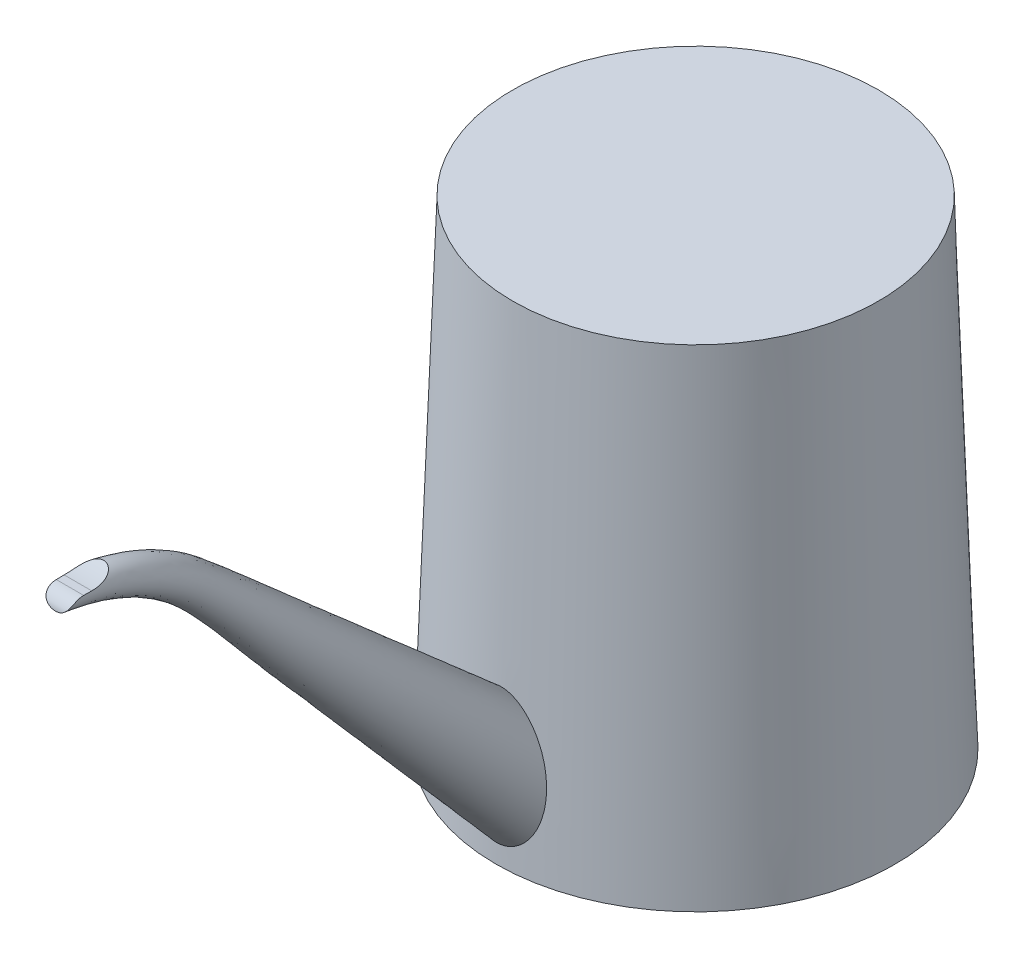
ISO-10303-21;
HEADER;
FILE_DESCRIPTION(('STEP AP214'),'2;1');
FILE_NAME('part.step','',(''),(''),'','','');
FILE_SCHEMA(('AUTOMOTIVE_DESIGN { 1 0 10303 214 1 1 1 1 }'));
ENDSEC;
DATA;
#1=APPLICATION_CONTEXT('core data for automotive mechanical design processes');
#2=APPLICATION_PROTOCOL_DEFINITION('international standard','automotive_design',2000,#1);
#3=PRODUCT_CONTEXT('',#1,'mechanical');
#4=PRODUCT('Part','Part','',(#3));
#5=PRODUCT_RELATED_PRODUCT_CATEGORY('part','',(#4));
#6=PRODUCT_DEFINITION_FORMATION('','',#4);
#7=PRODUCT_DEFINITION_CONTEXT('part definition',#1,'design');
#8=PRODUCT_DEFINITION('design','',#6,#7);
#9=PRODUCT_DEFINITION_SHAPE('','',#8);
#10=(LENGTH_UNIT() NAMED_UNIT(*) SI_UNIT(.MILLI.,.METRE.));
#11=(NAMED_UNIT(*) PLANE_ANGLE_UNIT() SI_UNIT($,.RADIAN.));
#12=(NAMED_UNIT(*) SI_UNIT($,.STERADIAN.) SOLID_ANGLE_UNIT());
#13=UNCERTAINTY_MEASURE_WITH_UNIT(LENGTH_MEASURE(1.E-05),#10,'distance_accuracy_value','');
#14=(GEOMETRIC_REPRESENTATION_CONTEXT(3) GLOBAL_UNCERTAINTY_ASSIGNED_CONTEXT((#13)) GLOBAL_UNIT_ASSIGNED_CONTEXT((#10,
#11,#12)) REPRESENTATION_CONTEXT('',''));
#15=CARTESIAN_POINT('',(0.,0.,0.));
#16=DIRECTION('',(0.,0.,1.));
#17=DIRECTION('',(1.,0.,0.));
#18=AXIS2_PLACEMENT_3D('',#15,#16,#17);
#19=CARTESIAN_POINT('',(0.0137913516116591,35.9210210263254,51.3460910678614));
#20=CARTESIAN_POINT('',(0.00853062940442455,47.1881624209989,64.2598504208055));
#21=CARTESIAN_POINT('',(0.000397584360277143,64.6000250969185,84.216206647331));
#22=CARTESIAN_POINT('',(-0.0101148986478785,87.1372068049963,110.046981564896));
#23=CARTESIAN_POINT('',(-0.018268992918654,104.550425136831,130.003797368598));
#24=CARTESIAN_POINT('',(-0.0258231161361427,120.950707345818,148.803713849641));
#25=CARTESIAN_POINT('',(-0.0342925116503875,138.338552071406,168.720379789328));
#26=CARTESIAN_POINT('',(-0.0429280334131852,161.042959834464,194.806477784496));
#27=CARTESIAN_POINT('',(-0.0627914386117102,181.433025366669,217.834366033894));
#28=CARTESIAN_POINT('',(-0.0552290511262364,198.939988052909,238.404401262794));
#29=CARTESIAN_POINT('',(-0.0530300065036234,205.722927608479,248.954972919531));
#30=CARTESIAN_POINT('',(-0.0511989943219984,210.37160475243,257.470493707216));
#31=CARTESIAN_POINT('',(-0.0488957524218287,215.245442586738,268.981393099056));
#32=CARTESIAN_POINT('',(-0.0471023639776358,218.093400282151,278.175481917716));
#33=CARTESIAN_POINT('',(-0.0447893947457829,220.926202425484,290.247832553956));
#34=CARTESIAN_POINT('',(-0.0433146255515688,221.558003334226,298.090562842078));
#35=CARTESIAN_POINT('',(-0.0421564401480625,222.224269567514,304.230493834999));
#36=CARTESIAN_POINT('',(-0.599524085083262,35.9213285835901,51.3457835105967));
#37=CARTESIAN_POINT('',(-0.579222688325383,47.1883524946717,64.2596602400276));
#38=CARTESIAN_POINT('',(-0.547460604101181,64.6000324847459,84.2161992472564));
#39=CARTESIAN_POINT('',(-0.506618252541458,87.1369857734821,110.047202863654));
#40=CARTESIAN_POINT('',(-0.475026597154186,104.550031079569,130.00419326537));
#41=CARTESIAN_POINT('',(-0.445276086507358,120.950154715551,148.804265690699));
#42=CARTESIAN_POINT('',(-0.413758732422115,138.337837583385,168.721106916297));
#43=CARTESIAN_POINT('',(-0.372471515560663,161.042043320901,194.80734067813));
#44=CARTESIAN_POINT('',(-0.336073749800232,181.43195334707,217.835745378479));
#45=CARTESIAN_POINT('',(-0.303527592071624,198.938789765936,238.405348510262));
#46=CARTESIAN_POINT('',(-0.288399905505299,205.721694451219,248.95576300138));
#47=CARTESIAN_POINT('',(-0.276665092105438,210.370355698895,257.471159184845));
#48=CARTESIAN_POINT('',(-0.26150819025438,215.244190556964,268.981902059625));
#49=CARTESIAN_POINT('',(-0.249779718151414,218.092160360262,278.175875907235));
#50=CARTESIAN_POINT('',(-0.234633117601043,220.924989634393,290.248084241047));
#51=CARTESIAN_POINT('',(-0.2249363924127,221.556822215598,298.090732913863));
#52=CARTESIAN_POINT('',(-0.217385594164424,222.223110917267,304.230598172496));
#53=CARTESIAN_POINT('',(-1.81464774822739,35.8816987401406,51.3854133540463));
#54=CARTESIAN_POINT('',(-1.74321031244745,47.1503431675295,64.2976869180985));
#55=CARTESIAN_POINT('',(-1.63299096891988,64.5645275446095,84.251753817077));
#56=CARTESIAN_POINT('',(-1.49024257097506,87.1047270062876,110.079533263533));
#57=CARTESIAN_POINT('',(-1.37991387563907,104.52029551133,130.034031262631));
#58=CARTESIAN_POINT('',(-1.27623177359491,120.922762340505,148.83171985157));
#59=CARTESIAN_POINT('',(-1.16547597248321,138.313085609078,168.746116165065));
#60=CARTESIAN_POINT('',(-1.02526247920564,161.019987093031,194.828630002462));
#61=CARTESIAN_POINT('',(-0.8773565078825,181.416200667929,217.856172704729));
#62=CARTESIAN_POINT('',(-0.795329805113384,198.92056339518,238.419752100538));
#63=CARTESIAN_POINT('',(-0.754592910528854,205.703145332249,248.967639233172));
#64=CARTESIAN_POINT('',(-0.723241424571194,210.351695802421,257.481094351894));
#65=CARTESIAN_POINT('',(-0.682622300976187,215.225690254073,268.989414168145));
#66=CARTESIAN_POINT('',(-0.651221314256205,218.074005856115,278.181640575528));
#67=CARTESIAN_POINT('',(-0.610635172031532,220.9074616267,290.251710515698));
#68=CARTESIAN_POINT('',(-0.584786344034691,221.539907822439,298.093185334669));
#69=CARTESIAN_POINT('',(-0.564452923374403,222.206646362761,304.232080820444));
#70=CARTESIAN_POINT('',(-3.5970697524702,35.7061534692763,51.5609586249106));
#71=CARTESIAN_POINT('',(-3.45097776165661,46.9825702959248,64.4655363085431));
#72=CARTESIAN_POINT('',(-3.22514312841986,64.4088073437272,84.4076917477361));
#73=CARTESIAN_POINT('',(-2.93296262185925,86.9645574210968,110.220015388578));
#74=CARTESIAN_POINT('',(-2.70706982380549,104.392190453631,130.162574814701));
#75=CARTESIAN_POINT('',(-2.49490195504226,120.805848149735,148.948909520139));
#76=CARTESIAN_POINT('',(-2.26786316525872,138.20868468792,168.851572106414));
#77=CARTESIAN_POINT('',(-1.98248960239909,160.928574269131,194.916990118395));
#78=CARTESIAN_POINT('',(-1.67089442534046,181.353326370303,217.937767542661));
#79=CARTESIAN_POINT('',(-1.51633953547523,198.847572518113,238.47743227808));
#80=CARTESIAN_POINT('',(-1.43805373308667,205.628940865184,249.015146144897));
#81=CARTESIAN_POINT('',(-1.37794025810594,210.277097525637,257.520810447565));
#82=CARTESIAN_POINT('',(-1.29998995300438,215.151808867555,269.019410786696));
#83=CARTESIAN_POINT('',(-1.23973982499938,218.001571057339,278.204638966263));
#84=CARTESIAN_POINT('',(-1.16186951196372,220.837616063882,290.266157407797));
#85=CARTESIAN_POINT('',(-1.11223102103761,221.472576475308,298.102941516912));
#86=CARTESIAN_POINT('',(-1.07325238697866,222.141151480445,304.237978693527));
#87=CARTESIAN_POINT('',(-5.33348640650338,35.4191420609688,51.847970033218));
#88=CARTESIAN_POINT('',(-5.11451955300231,46.7085206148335,64.7397115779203));
#89=CARTESIAN_POINT('',(-4.77615303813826,64.1547026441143,84.6621515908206));
#90=CARTESIAN_POINT('',(-4.33830313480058,86.7362779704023,110.448804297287));
#91=CARTESIAN_POINT('',(-3.99978819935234,104.183923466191,130.371553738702));
#92=CARTESIAN_POINT('',(-3.68188952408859,120.616144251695,149.139064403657));
#93=CARTESIAN_POINT('',(-3.34152061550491,138.039706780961,169.022247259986));
#94=CARTESIAN_POINT('',(-2.91468497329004,160.78117411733,195.059511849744));
#95=CARTESIAN_POINT('',(-2.44350544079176,181.252787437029,218.068264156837));
#96=CARTESIAN_POINT('',(-2.21834683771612,198.730768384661,238.569734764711));
#97=CARTESIAN_POINT('',(-2.10349734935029,205.510223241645,249.091149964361));
#98=CARTESIAN_POINT('',(-2.01537763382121,210.157767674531,257.584340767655));
#99=CARTESIAN_POINT('',(-1.90107598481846,215.033654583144,269.067381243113));
#100=CARTESIAN_POINT('',(-1.81273594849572,217.88575326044,278.241412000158));
#101=CARTESIAN_POINT('',(-1.69855611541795,220.725972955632,290.289245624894));
#102=CARTESIAN_POINT('',(-1.62578441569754,221.364961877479,298.118559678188));
#103=CARTESIAN_POINT('',(-1.56862172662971,222.036502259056,304.247402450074));
#104=CARTESIAN_POINT('',(-15.4415030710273,33.0560829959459,54.2110290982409));
#105=CARTESIAN_POINT('',(-14.7986383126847,44.4517232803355,66.997531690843));
#106=CARTESIAN_POINT('',(-13.8042968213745,62.0646683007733,86.7551101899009));
#107=CARTESIAN_POINT('',(-12.5182613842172,84.8599025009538,112.329368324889));
#108=CARTESIAN_POINT('',(-11.5238453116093,102.473409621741,132.087911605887));
#109=CARTESIAN_POINT('',(-10.5902158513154,119.05939323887,150.699530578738));
#110=CARTESIAN_POINT('',(-9.58983678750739,136.654554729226,170.421274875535));
#111=CARTESIAN_POINT('',(-8.33923412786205,159.574895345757,196.22602563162));
#112=CARTESIAN_POINT('',(-6.93836612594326,180.433049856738,219.132342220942));
#113=CARTESIAN_POINT('',(-6.30252278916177,197.778092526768,239.322568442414));
#114=CARTESIAN_POINT('',(-5.97492507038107,204.542044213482,249.710980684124));
#115=CARTESIAN_POINT('',(-5.72385425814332,209.184661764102,258.102410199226));
#116=CARTESIAN_POINT('',(-5.39804626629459,214.070235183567,269.458528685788));
#117=CARTESIAN_POINT('',(-5.14626026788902,216.941485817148,278.541202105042));
#118=CARTESIAN_POINT('',(-4.82083542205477,219.815821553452,290.477516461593));
#119=CARTESIAN_POINT('',(-4.61332717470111,220.488019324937,298.245345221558));
#120=CARTESIAN_POINT('',(-4.4504854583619,221.183543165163,304.324212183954));
#121=CARTESIAN_POINT('',(-22.2189063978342,25.9017968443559,61.3653152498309));
#122=CARTESIAN_POINT('',(-21.2799310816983,37.6573710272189,73.7953053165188));
#123=CARTESIAN_POINT('',(-19.8565495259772,55.7387181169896,93.0898182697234));
#124=CARTESIAN_POINT('',(-17.9958906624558,79.198474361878,118.003459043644));
#125=CARTESIAN_POINT('',(-16.559985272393,97.3182282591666,137.260681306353));
#126=CARTESIAN_POINT('',(-15.2112709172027,114.375620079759,155.394564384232));
#127=CARTESIAN_POINT('',(-13.7660472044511,132.495589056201,174.621689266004));
#128=CARTESIAN_POINT('',(-11.9607669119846,155.964451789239,199.718358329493));
#129=CARTESIAN_POINT('',(-9.93078190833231,177.996942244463,222.295055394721));
#130=CARTESIAN_POINT('',(-9.02209555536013,194.945070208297,241.561299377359));
#131=CARTESIAN_POINT('',(-8.5526212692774,201.663519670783,251.553791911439));
#132=CARTESIAN_POINT('',(-8.192939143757,206.291830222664,259.642542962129));
#133=CARTESIAN_POINT('',(-7.72608324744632,211.206912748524,270.620864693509));
#134=CARTESIAN_POINT('',(-7.36546635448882,214.135163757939,279.432732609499));
#135=CARTESIAN_POINT('',(-6.89883316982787,217.112735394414,291.03506318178));
#136=CARTESIAN_POINT('',(-6.60416057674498,217.875781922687,298.637440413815));
#137=CARTESIAN_POINT('',(-6.36847348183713,218.650380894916,304.552325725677));
#138=CARTESIAN_POINT('',(-22.232607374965,8.05898295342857,79.208129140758));
#139=CARTESIAN_POINT('',(-21.3108319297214,20.5669915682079,90.8928073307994));
#140=CARTESIAN_POINT('',(-19.8513588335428,40.0059335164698,108.844786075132));
#141=CARTESIAN_POINT('',(-17.9867358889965,65.0857352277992,132.147700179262));
#142=CARTESIAN_POINT('',(-16.5415638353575,84.479931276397,150.142789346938));
#143=CARTESIAN_POINT('',(-15.1856805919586,102.71460717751,167.083665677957));
#144=CARTESIAN_POINT('',(-13.7319604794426,122.147826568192,185.072429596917));
#145=CARTESIAN_POINT('',(-11.9181307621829,146.989421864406,208.400432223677));
#146=CARTESIAN_POINT('',(-9.86840242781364,171.953668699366,230.14117767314));
#147=CARTESIAN_POINT('',(-8.96722708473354,187.915845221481,247.115963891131));
#148=CARTESIAN_POINT('',(-8.49994076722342,194.521805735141,256.125866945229));
#149=CARTESIAN_POINT('',(-8.14205444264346,199.115027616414,263.463239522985));
#150=CARTESIAN_POINT('',(-7.67757189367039,204.103244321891,273.505136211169));
#151=CARTESIAN_POINT('',(-7.31843069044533,207.175080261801,281.641342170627));
#152=CARTESIAN_POINT('',(-6.85495444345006,210.404124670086,292.425578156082));
#153=CARTESIAN_POINT('',(-6.55566236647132,211.429094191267,299.543041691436));
#154=CARTESIAN_POINT('',(-6.32659329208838,212.367554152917,305.118099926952));
#155=CARTESIAN_POINT('',(-12.2801000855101,0.00615460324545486,87.260957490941));
#156=CARTESIAN_POINT('',(-11.8152811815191,12.9253917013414,98.5382789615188));
#157=CARTESIAN_POINT('',(-10.9446883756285,32.8922676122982,115.968293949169));
#158=CARTESIAN_POINT('',(-9.92201216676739,58.7266928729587,138.520973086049));
#159=CARTESIAN_POINT('',(-9.11625585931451,78.694887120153,155.947556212));
#160=CARTESIAN_POINT('',(-8.36338280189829,97.464187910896,172.346768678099));
#161=CARTESIAN_POINT('',(-7.55498827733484,117.492107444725,189.77438997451));
#162=CARTESIAN_POINT('',(-6.54796596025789,142.956233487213,212.302357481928));
#163=CARTESIAN_POINT('',(-5.40285603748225,169.245314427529,233.657694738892));
#164=CARTESIAN_POINT('',(-4.91073858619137,184.764832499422,249.605970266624));
#165=CARTESIAN_POINT('',(-4.65437273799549,191.320631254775,258.175218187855));
#166=CARTESIAN_POINT('',(-4.45807243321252,195.898221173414,265.175845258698));
#167=CARTESIAN_POINT('',(-4.20350541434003,200.919706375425,274.797427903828));
#168=CARTESIAN_POINT('',(-4.00586838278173,204.055269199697,282.632508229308));
#169=CARTESIAN_POINT('',(-3.75355511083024,207.399653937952,293.045122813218));
#170=CARTESIAN_POINT('',(-3.57609763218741,208.525558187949,299.980169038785));
#171=CARTESIAN_POINT('',(-3.46242664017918,209.552557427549,305.371592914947));
#172=CARTESIAN_POINT('',(12.2525173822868,-0.00614768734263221,87.2732597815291));
#173=CARTESIAN_POINT('',(11.7982193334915,12.9173108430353,98.5463579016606));
#174=CARTESIAN_POINT('',(10.9438933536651,32.8920911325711,115.968472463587));
#175=CARTESIAN_POINT('',(9.94224194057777,58.7355150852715,138.512139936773));
#176=CARTESIAN_POINT('',(9.15279385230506,78.7106552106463,155.93171461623));
#177=CARTESIAN_POINT('',(8.41502903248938,97.4862917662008,172.324696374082));
#178=CARTESIAN_POINT('',(7.62357330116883,117.520687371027,189.745304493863));
#179=CARTESIAN_POINT('',(6.63382202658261,142.992893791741,212.267841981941));
#180=CARTESIAN_POINT('',(5.52843891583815,169.288195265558,233.602520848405));
#181=CARTESIAN_POINT('',(5.02119668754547,184.812763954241,249.568080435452));
#182=CARTESIAN_POINT('',(4.7604327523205,191.369957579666,258.14361481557));
#183=CARTESIAN_POINT('',(4.56047040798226,195.948182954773,265.149227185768));
#184=CARTESIAN_POINT('',(4.30129696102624,200.969788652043,274.777066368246));
#185=CARTESIAN_POINT('',(4.10007295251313,204.104861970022,282.616760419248));
#186=CARTESIAN_POINT('',(3.84313430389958,207.448176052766,293.035025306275));
#187=CARTESIAN_POINT('',(3.66272330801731,208.572710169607,299.973632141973));
#188=CARTESIAN_POINT('',(3.5467395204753,209.598903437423,305.367419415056));
#189=CARTESIAN_POINT('',(22.2173840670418,8.03669276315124,79.2304193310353));
#190=CARTESIAN_POINT('',(21.3009256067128,20.5531442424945,90.906650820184));
#191=CARTESIAN_POINT('',(19.8510420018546,40.0054159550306,108.845307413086));
#192=CARTESIAN_POINT('',(17.9978814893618,65.1017516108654,132.131663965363));
#193=CARTESIAN_POINT('',(16.561735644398,84.5084914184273,150.11409602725));
#194=CARTESIAN_POINT('',(15.214183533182,102.754658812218,167.043671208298));
#195=CARTESIAN_POINT('',(13.7698139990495,122.199609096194,185.019731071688));
#196=CARTESIAN_POINT('',(11.9655157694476,147.055846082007,208.337894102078));
#197=CARTESIAN_POINT('',(9.9377135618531,172.031363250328,230.041209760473));
#198=CARTESIAN_POINT('',(9.02819054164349,188.002690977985,247.04731220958));
#199=CARTESIAN_POINT('',(8.55847692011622,194.611178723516,256.068605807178));
#200=CARTESIAN_POINT('',(8.19856901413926,199.205552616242,263.415009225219));
#201=CARTESIAN_POINT('',(7.73154574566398,204.193985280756,273.468248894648));
#202=CARTESIAN_POINT('',(7.37041895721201,207.264942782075,281.612789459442));
#203=CARTESIAN_POINT('',(6.90440640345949,210.492023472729,292.407332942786));
#204=CARTESIAN_POINT('',(6.60336732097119,211.51467922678,299.530753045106));
#205=CARTESIAN_POINT('',(6.37312683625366,212.451527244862,305.110538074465));
#206=CARTESIAN_POINT('',(22.2310850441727,25.8795066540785,61.3876054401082));
#207=CARTESIAN_POINT('',(21.2878566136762,37.6437277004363,73.8089488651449));
#208=CARTESIAN_POINT('',(19.8568028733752,55.7381497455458,93.0903894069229));
#209=CARTESIAN_POINT('',(17.9869742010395,79.2144988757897,117.987414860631));
#210=CARTESIAN_POINT('',(16.5438478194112,97.3467859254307,137.23199041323));
#211=CARTESIAN_POINT('',(15.1884685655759,114.415672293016,155.354569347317));
#212=CARTESIAN_POINT('',(13.7357643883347,132.547371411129,174.568990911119));
#213=CARTESIAN_POINT('',(11.9228589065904,156.030876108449,199.655820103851));
#214=CARTESIAN_POINT('',(9.87533300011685,178.074636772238,222.19508752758));
#215=CARTESIAN_POINT('',(8.97332479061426,195.031915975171,241.492647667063));
#216=CARTESIAN_POINT('',(8.50579234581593,201.752892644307,251.496530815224));
#217=CARTESIAN_POINT('',(8.14772749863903,206.382355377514,259.594312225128));
#218=CARTESIAN_POINT('',(7.68290412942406,211.297653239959,270.583978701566));
#219=CARTESIAN_POINT('',(7.32387587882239,214.225028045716,279.40417488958));
#220=CARTESIAN_POINT('',(6.85927125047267,217.200629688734,291.016830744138));
#221=CARTESIAN_POINT('',(6.56599972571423,217.961406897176,298.625038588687));
#222=CARTESIAN_POINT('',(6.3312466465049,218.734353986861,304.54476387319));
#223=CARTESIAN_POINT('',(15.4646740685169,33.0405845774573,54.2265275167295));
#224=CARTESIAN_POINT('',(14.812960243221,44.4421745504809,67.0070853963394));
#225=CARTESIAN_POINT('',(13.8049674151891,62.06428867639,86.7554905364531));
#226=CARTESIAN_POINT('',(12.5012668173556,84.8710418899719,112.318215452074));
#227=CARTESIAN_POINT('',(11.4931515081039,102.493266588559,132.06796194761));
#228=CARTESIAN_POINT('',(10.5468301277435,119.087241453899,150.67172213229));
#229=CARTESIAN_POINT('',(9.53222158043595,136.690559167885,170.384633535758));
#230=CARTESIAN_POINT('',(8.26711027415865,159.621080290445,196.182542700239));
#231=CARTESIAN_POINT('',(6.83286955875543,180.48707104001,219.06283432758));
#232=CARTESIAN_POINT('',(6.20973186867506,197.838476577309,239.274834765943));
#233=CARTESIAN_POINT('',(5.88582878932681,204.604185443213,249.671166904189));
#234=CARTESIAN_POINT('',(5.63783427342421,209.247604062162,258.068875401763));
#235=CARTESIAN_POINT('',(5.31589600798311,214.13332737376,269.432881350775));
#236=CARTESIAN_POINT('',(5.06712301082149,217.003968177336,278.521347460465));
#237=CARTESIAN_POINT('',(4.74558446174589,219.876935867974,290.464835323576));
#238=CARTESIAN_POINT('',(4.5405522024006,220.547543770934,298.236758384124));
#239=CARTESIAN_POINT('',(4.3796579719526,221.2419298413,304.318954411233));
#240=CARTESIAN_POINT('',(5.36029423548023,35.4137794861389,51.8533326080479));
#241=CARTESIAN_POINT('',(5.13110190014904,46.7052177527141,64.743016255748));
#242=CARTESIAN_POINT('',(4.77692577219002,64.154571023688,84.6622834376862));
#243=CARTESIAN_POINT('',(4.31864166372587,86.7401323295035,110.444945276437));
#244=CARTESIAN_POINT('',(3.96427666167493,104.190794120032,130.364651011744));
#245=CARTESIAN_POINT('',(3.63169417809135,120.625779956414,149.129442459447));
#246=CARTESIAN_POINT('',(3.27486233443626,138.05216459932,169.009569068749));
#247=CARTESIAN_POINT('',(2.83124084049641,160.797154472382,195.044466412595));
#248=CARTESIAN_POINT('',(2.32145053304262,181.271479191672,218.044213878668));
#249=CARTESIAN_POINT('',(2.11099180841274,198.751661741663,238.553218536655));
#250=CARTESIAN_POINT('',(2.00041685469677,205.531724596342,249.077374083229));
#251=CARTESIAN_POINT('',(1.91585628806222,210.179546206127,257.572737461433));
#252=CARTESIAN_POINT('',(1.80603171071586,215.055484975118,269.058507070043));
#253=CARTESIAN_POINT('',(1.72117770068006,217.907372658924,278.234542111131));
#254=CARTESIAN_POINT('',(1.61149381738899,220.747118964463,290.284857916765));
#255=CARTESIAN_POINT('',(1.54158903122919,221.38555802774,298.115587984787));
#256=CARTESIAN_POINT('',(1.4866774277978,222.056704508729,304.245583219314));
#257=CARTESIAN_POINT('',(3.62431969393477,35.7025321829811,51.5645799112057));
#258=CARTESIAN_POINT('',(3.46783308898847,46.9803396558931,64.467768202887));
#259=CARTESIAN_POINT('',(3.22592872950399,64.4087185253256,84.4077807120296));
#260=CARTESIAN_POINT('',(2.91297687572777,86.9671602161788,110.217409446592));
#261=CARTESIAN_POINT('',(2.67097263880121,104.39683013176,130.157913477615));
#262=CARTESIAN_POINT('',(2.44387879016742,120.812355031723,148.942411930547));
#263=CARTESIAN_POINT('',(2.20010556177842,138.217097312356,168.843010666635));
#264=CARTESIAN_POINT('',(1.89766931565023,160.93936562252,194.90683010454));
#265=CARTESIAN_POINT('',(1.54682659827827,181.365948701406,217.921526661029));
#266=CARTESIAN_POINT('',(1.40721401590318,198.861681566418,238.466279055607));
#267=CARTESIAN_POINT('',(1.33327324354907,205.643460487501,249.005843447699));
#268=CARTESIAN_POINT('',(1.27677761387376,210.291804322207,257.512974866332));
#269=CARTESIAN_POINT('',(1.20337821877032,215.166550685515,269.013418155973));
#270=CARTESIAN_POINT('',(1.14667159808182,218.016170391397,278.199999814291));
#271=CARTESIAN_POINT('',(1.07337141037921,220.851895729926,290.26319442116));
#272=CARTESIAN_POINT('',(1.02664691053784,221.486484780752,298.100934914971));
#273=CARTESIAN_POINT('',(0.989956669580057,222.154793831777,304.236750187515));
#274=CARTESIAN_POINT('',(1.84216865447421,35.8798649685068,51.38724712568));
#275=CARTESIAN_POINT('',(1.76023337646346,47.1492142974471,64.2988164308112));
#276=CARTESIAN_POINT('',(1.63378434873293,64.5644823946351,84.2517990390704));
#277=CARTESIAN_POINT('',(1.47005809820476,87.1060450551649,110.078213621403));
#278=CARTESIAN_POINT('',(1.3434577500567,104.522644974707,130.031670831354));
#279=CARTESIAN_POINT('',(1.22470125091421,120.926057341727,148.828429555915));
#280=CARTESIAN_POINT('',(1.09704460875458,138.317345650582,168.74178076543));
#281=CARTESIAN_POINT('',(0.939598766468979,161.025451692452,194.823485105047));
#282=CARTESIAN_POINT('',(0.752054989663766,181.422592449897,217.84794853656));
#283=CARTESIAN_POINT('',(0.685119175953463,198.927708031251,238.414104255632));
#284=CARTESIAN_POINT('',(0.648770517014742,205.710497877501,248.962928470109));
#285=CARTESIAN_POINT('',(0.621072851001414,210.359143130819,257.477126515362));
#286=CARTESIAN_POINT('',(0.58504989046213,215.233155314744,268.986379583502));
#287=CARTESIAN_POINT('',(0.557227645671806,218.08139877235,278.179291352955));
#288=CARTESIAN_POINT('',(0.521257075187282,220.914692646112,290.250210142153));
#289=CARTESIAN_POINT('',(0.498351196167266,221.546950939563,298.092168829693));
#290=CARTESIAN_POINT('',(0.480328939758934,222.213554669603,304.231458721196));
#291=CARTESIAN_POINT('',(0.627106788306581,35.9207134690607,51.3463986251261));
#292=CARTESIAN_POINT('',(0.596283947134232,47.1879723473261,64.2600406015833));
#293=CARTESIAN_POINT('',(0.548255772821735,64.6000177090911,84.2162140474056));
#294=CARTESIAN_POINT('',(0.486388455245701,87.1374278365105,110.046760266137));
#295=CARTESIAN_POINT('',(0.438488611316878,104.550819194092,130.003401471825));
#296=CARTESIAN_POINT('',(0.393629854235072,120.951259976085,148.803162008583));
#297=CARTESIAN_POINT('',(0.34517370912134,138.339266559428,168.719652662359));
#298=CARTESIAN_POINT('',(0.286615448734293,161.043876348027,194.805614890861));
#299=CARTESIAN_POINT('',(0.210490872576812,181.434097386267,217.832986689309));
#300=CARTESIAN_POINT('',(0.193069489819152,198.941186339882,238.403454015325));
#301=CARTESIAN_POINT('',(0.182339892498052,205.724160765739,248.954182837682));
#302=CARTESIAN_POINT('',(0.174267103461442,210.372853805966,257.469828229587));
#303=CARTESIAN_POINT('',(0.163716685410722,215.246694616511,268.980884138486));
#304=CARTESIAN_POINT('',(0.155574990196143,218.094640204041,278.175087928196));
#305=CARTESIAN_POINT('',(0.145054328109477,220.927415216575,290.247580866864));
#306=CARTESIAN_POINT('',(0.138307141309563,221.559184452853,298.090392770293));
#307=CARTESIAN_POINT('',(0.133072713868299,222.22542821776,304.230389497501));
#308=CARTESIAN_POINT('',(0.0137913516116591,35.9210210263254,51.3460910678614));
#309=CARTESIAN_POINT('',(0.00853062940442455,47.1881624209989,64.2598504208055));
#310=CARTESIAN_POINT('',(0.000397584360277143,64.6000250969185,84.216206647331));
#311=CARTESIAN_POINT('',(-0.0101148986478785,87.1372068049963,110.046981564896));
#312=CARTESIAN_POINT('',(-0.018268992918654,104.550425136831,130.003797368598));
#313=CARTESIAN_POINT('',(-0.0258231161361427,120.950707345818,148.803713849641));
#314=CARTESIAN_POINT('',(-0.0342925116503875,138.338552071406,168.720379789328));
#315=CARTESIAN_POINT('',(-0.0429280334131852,161.042959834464,194.806477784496));
#316=CARTESIAN_POINT('',(-0.0627914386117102,181.433025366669,217.834366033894));
#317=CARTESIAN_POINT('',(-0.0552290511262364,198.939988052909,238.404401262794));
#318=CARTESIAN_POINT('',(-0.0530300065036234,205.722927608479,248.954972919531));
#319=CARTESIAN_POINT('',(-0.0511989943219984,210.37160475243,257.470493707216));
#320=CARTESIAN_POINT('',(-0.0488957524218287,215.245442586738,268.981393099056));
#321=CARTESIAN_POINT('',(-0.0471023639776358,218.093400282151,278.175481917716));
#322=CARTESIAN_POINT('',(-0.0447893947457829,220.926202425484,290.247832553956));
#323=CARTESIAN_POINT('',(-0.0433146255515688,221.558003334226,298.090562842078));
#324=CARTESIAN_POINT('',(-0.0421564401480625,222.224269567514,304.230493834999));
#325=B_SPLINE_SURFACE_WITH_KNOTS('',3,3,((#19,#20,#21,#22,#23,#24,#25,#26,#27,#28,#29,#30,#31,
#32,#33,#34,#35),(#36,#37,#38,#39,#40,#41,#42,#43,#44,#45,#46,#47,#48,#49,#50,#51,#52),(#53,#54,
#55,#56,#57,#58,#59,#60,#61,#62,#63,#64,#65,#66,#67,#68,#69),(#70,#71,#72,#73,#74,#75,#76,#77,
#78,#79,#80,#81,#82,#83,#84,#85,#86),(#87,#88,#89,#90,#91,#92,#93,#94,#95,#96,#97,#98,#99,#100,
#101,#102,#103),(#104,#105,#106,#107,#108,#109,#110,#111,#112,#113,#114,#115,#116,#117,#118,
#119,#120),(#121,#122,#123,#124,#125,#126,#127,#128,#129,#130,#131,#132,#133,#134,#135,#136,
#137),(#138,#139,#140,#141,#142,#143,#144,#145,#146,#147,#148,#149,#150,#151,#152,#153,#154),
(#155,#156,#157,#158,#159,#160,#161,#162,#163,#164,#165,#166,#167,#168,#169,#170,#171),(#172,
#173,#174,#175,#176,#177,#178,#179,#180,#181,#182,#183,#184,#185,#186,#187,#188),(#189,#190,
#191,#192,#193,#194,#195,#196,#197,#198,#199,#200,#201,#202,#203,#204,#205),(#206,#207,#208,
#209,#210,#211,#212,#213,#214,#215,#216,#217,#218,#219,#220,#221,#222),(#223,#224,#225,#226,
#227,#228,#229,#230,#231,#232,#233,#234,#235,#236,#237,#238,#239),(#240,#241,#242,#243,#244,
#245,#246,#247,#248,#249,#250,#251,#252,#253,#254,#255,#256),(#257,#258,#259,#260,#261,#262,
#263,#264,#265,#266,#267,#268,#269,#270,#271,#272,#273),(#274,#275,#276,#277,#278,#279,#280,
#281,#282,#283,#284,#285,#286,#287,#288,#289,#290),(#291,#292,#293,#294,#295,#296,#297,#298,
#299,#300,#301,#302,#303,#304,#305,#306,#307),(#308,#309,#310,#311,#312,#313,#314,#315,#316,
#317,#318,#319,#320,#321,#322,#323,#324)),.UNSPECIFIED.,.T.,.F.,.F.,(4,1,1,1,1,2,2,2,1,1,1,1,4),
(4,1,1,1,1,1,1,1,1,1,1,1,1,1,4),(0.,0.0125,0.0249999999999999,0.0375000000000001,0.05,0.25,0.5,
0.75,0.95,0.9625,0.975,0.9875,1.),(0.,0.164162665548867,0.253705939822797,0.328325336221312,
0.417868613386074,0.49248801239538,0.582031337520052,0.746190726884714,0.802008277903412,
0.817246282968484,0.857862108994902,0.888329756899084,0.928945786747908,0.944183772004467,1.),.UNSPECIFIED.);
#326=CARTESIAN_POINT('',(0.,8.79638906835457,94.9428233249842));
#327=CARTESIAN_POINT('',(-0.458097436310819,8.79641152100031,94.9428210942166));
#328=CARTESIAN_POINT('',(-0.916292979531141,8.81644238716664,94.9387977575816));
#329=CARTESIAN_POINT('',(-1.82905913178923,8.89681353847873,94.9227941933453));
#330=CARTESIAN_POINT('',(-2.28362886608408,8.95716326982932,94.9108121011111));
#331=CARTESIAN_POINT('',(-3.18575827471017,9.11760783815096,94.8792106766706));
#332=CARTESIAN_POINT('',(-3.63331279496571,9.21773059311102,94.8595859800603));
#333=CARTESIAN_POINT('',(-4.51766757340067,9.45627931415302,94.8132443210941));
#334=CARTESIAN_POINT('',(-4.95446824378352,9.59470380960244,94.7865276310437));
#335=CARTESIAN_POINT('',(-5.81234458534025,9.90701367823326,94.7268566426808));
#336=CARTESIAN_POINT('',(-6.23348545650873,10.0807263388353,94.6939327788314));
#337=CARTESIAN_POINT('',(-7.059872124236,10.4615048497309,94.6225765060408));
#338=CARTESIAN_POINT('',(-7.46511806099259,10.6685704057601,94.5841441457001));
#339=CARTESIAN_POINT('',(-8.25802845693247,11.1133549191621,94.5026263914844));
#340=CARTESIAN_POINT('',(-8.64568778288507,11.3510827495,94.4595396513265));
#341=CARTESIAN_POINT('',(-9.40212862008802,11.854376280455,94.3695860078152));
#342=CARTESIAN_POINT('',(-9.77090598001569,12.1199480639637,94.3227182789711));
#343=CARTESIAN_POINT('',(-10.3733319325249,12.5867193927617,94.2415942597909));
#344=CARTESIAN_POINT('',(-10.6123382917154,12.7811974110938,94.2081223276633));
#345=CARTESIAN_POINT('',(-11.0810269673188,13.1807792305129,94.1400940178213));
#346=CARTESIAN_POINT('',(-11.310711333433,13.3858806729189,94.1055378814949));
#347=CARTESIAN_POINT('',(-11.9858655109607,14.0161245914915,94.0005718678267));
#348=CARTESIAN_POINT('',(-12.4173648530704,14.4561507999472,93.9288741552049));
#349=CARTESIAN_POINT('',(-13.2433202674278,15.3703366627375,93.7837472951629));
#350=CARTESIAN_POINT('',(-13.6377223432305,15.8445443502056,93.7103158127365));
#351=CARTESIAN_POINT('',(-14.3894364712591,16.8213868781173,93.5633222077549));
#352=CARTESIAN_POINT('',(-14.7467470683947,17.3240228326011,93.4897600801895));
#353=CARTESIAN_POINT('',(-15.5541474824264,18.5488036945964,93.316051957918));
#354=CARTESIAN_POINT('',(-15.9879232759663,19.281804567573,93.2164222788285));
#355=CARTESIAN_POINT('',(-16.789792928,20.7835093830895,93.0220466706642));
#356=CARTESIAN_POINT('',(-17.1578633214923,21.552225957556,92.9273024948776));
#357=CARTESIAN_POINT('',(-17.8319768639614,23.1180033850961,92.7446269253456));
#358=CARTESIAN_POINT('',(-18.1379558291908,23.9150925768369,92.6567026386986));
#359=CARTESIAN_POINT('',(-18.6907887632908,25.5301638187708,92.489226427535));
#360=CARTESIAN_POINT('',(-18.9376424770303,26.348145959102,92.409674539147));
#361=CARTESIAN_POINT('',(-19.4617604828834,28.3249918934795,92.2304458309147));
#362=CARTESIAN_POINT('',(-19.7127564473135,29.4913131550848,92.1351708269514));
#363=CARTESIAN_POINT('',(-20.0138805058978,31.2543153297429,92.0070243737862));
#364=CARTESIAN_POINT('',(-20.1017091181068,31.844421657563,91.9667596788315));
#365=CARTESIAN_POINT('',(-20.2531440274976,33.0280899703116,91.8912050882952));
#366=CARTESIAN_POINT('',(-20.3167508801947,33.6216518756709,91.8559150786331));
#367=CARTESIAN_POINT('',(-20.4206447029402,34.8118956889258,91.7902935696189));
#368=CARTESIAN_POINT('',(-20.4608989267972,35.4085807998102,91.7599690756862));
#369=CARTESIAN_POINT('',(-20.5187346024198,36.6032795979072,91.7043027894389));
#370=CARTESIAN_POINT('',(-20.5363158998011,37.2012932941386,91.6789610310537));
#371=CARTESIAN_POINT('',(-20.5495001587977,38.3976736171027,91.633190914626));
#372=CARTESIAN_POINT('',(-20.5451055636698,38.9960401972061,91.6127620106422));
#373=CARTESIAN_POINT('',(-20.5150496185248,40.1923795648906,91.5766850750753));
#374=CARTESIAN_POINT('',(-20.4893881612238,40.7903523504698,91.5610370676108));
#375=CARTESIAN_POINT('',(-20.4159111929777,42.0035074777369,91.5340443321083));
#376=CARTESIAN_POINT('',(-20.3674385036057,42.6186533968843,91.522846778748));
#377=CARTESIAN_POINT('',(-20.24811609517,43.8468414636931,91.5053928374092));
#378=CARTESIAN_POINT('',(-20.1772663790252,44.459883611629,91.499136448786));
#379=CARTESIAN_POINT('',(-20.0131645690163,45.6830626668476,91.4914459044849));
#380=CARTESIAN_POINT('',(-19.9199100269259,46.2931992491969,91.490012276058));
#381=CARTESIAN_POINT('',(-19.7109058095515,47.5096013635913,91.4918165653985));
#382=CARTESIAN_POINT('',(-19.5951562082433,48.1158669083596,91.4950544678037));
#383=CARTESIAN_POINT('',(-19.3411395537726,49.3228541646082,91.5060078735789));
#384=CARTESIAN_POINT('',(-19.2029001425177,49.9235817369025,91.5137179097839));
#385=CARTESIAN_POINT('',(-18.9035270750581,51.1192324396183,91.5333926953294));
#386=CARTESIAN_POINT('',(-18.7423937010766,51.7141556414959,91.5453573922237));
#387=CARTESIAN_POINT('',(-18.3968782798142,52.8969509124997,91.5732882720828));
#388=CARTESIAN_POINT('',(-18.21250277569,53.4848249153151,91.589253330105));
#389=CARTESIAN_POINT('',(-17.8199460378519,54.6524008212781,91.6249027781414));
#390=CARTESIAN_POINT('',(-17.611766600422,55.2321033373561,91.6445868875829));
#391=CARTESIAN_POINT('',(-17.0972569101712,56.5740412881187,91.6945070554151));
#392=CARTESIAN_POINT('',(-16.7813633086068,57.3325966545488,91.7260718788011));
#393=CARTESIAN_POINT('',(-16.1037631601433,58.8287590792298,91.7944121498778));
#394=CARTESIAN_POINT('',(-15.7420564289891,59.566366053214,91.8311876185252));
#395=CARTESIAN_POINT('',(-14.9701589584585,61.0150406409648,91.9089210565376));
#396=CARTESIAN_POINT('',(-14.5600073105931,61.7261290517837,91.9498756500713));
#397=CARTESIAN_POINT('',(-13.9056745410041,62.7678335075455,92.0135296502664));
#398=CARTESIAN_POINT('',(-13.6810598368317,63.1108949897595,92.0351167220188));
#399=CARTESIAN_POINT('',(-13.2182282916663,63.7876630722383,92.0788532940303));
#400=CARTESIAN_POINT('',(-12.9800124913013,64.1213703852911,92.1010027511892));
#401=CARTESIAN_POINT('',(-12.4016542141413,64.89567247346,92.1536566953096));
#402=CARTESIAN_POINT('',(-12.0555237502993,65.3318193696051,92.1843166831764));
#403=CARTESIAN_POINT('',(-11.3356394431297,66.1807587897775,92.2457363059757));
#404=CARTESIAN_POINT('',(-10.9618850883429,66.5935508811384,92.2764959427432));
#405=CARTESIAN_POINT('',(-10.1857024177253,67.3905118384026,92.3373931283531));
#406=CARTESIAN_POINT('',(-9.78331242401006,67.7747176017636,92.3675314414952));
#407=CARTESIAN_POINT('',(-9.15724617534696,68.3252799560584,92.4116675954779));
#408=CARTESIAN_POINT('',(-8.94483572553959,68.5044909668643,92.4261995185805));
#409=CARTESIAN_POINT('',(-8.51232551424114,68.853546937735,92.4547955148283));
#410=CARTESIAN_POINT('',(-8.29222396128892,69.0233896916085,92.4688594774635));
#411=CARTESIAN_POINT('',(-7.74581463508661,69.4251492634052,92.5024456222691));
#412=CARTESIAN_POINT('',(-7.41536902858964,69.6515158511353,92.521648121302));
#413=CARTESIAN_POINT('',(-6.7388380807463,70.0795393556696,92.5583954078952));
#414=CARTESIAN_POINT('',(-6.39275732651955,70.2812034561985,92.5759406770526));
#415=CARTESIAN_POINT('',(-5.68573186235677,70.6563771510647,92.6089251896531));
#416=CARTESIAN_POINT('',(-5.3247957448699,70.8299027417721,92.6243656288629));
#417=CARTESIAN_POINT('',(-4.58922461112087,71.1454137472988,92.6526911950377));
#418=CARTESIAN_POINT('',(-4.21458974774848,71.2873995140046,92.6655763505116));
#419=CARTESIAN_POINT('',(-3.44953490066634,71.5378597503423,92.6884731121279));
#420=CARTESIAN_POINT('',(-3.05898635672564,71.6459471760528,92.6984514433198));
#421=CARTESIAN_POINT('',(-2.26908908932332,71.8235768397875,92.714943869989));
#422=CARTESIAN_POINT('',(-1.86974030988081,71.8931188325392,92.7214579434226));
#423=CARTESIAN_POINT('',(-1.0662755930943,71.9917280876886,92.730732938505));
#424=CARTESIAN_POINT('',(-0.662162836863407,72.020820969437,92.7334962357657));
#425=CARTESIAN_POINT('',(0.14692444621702,72.0381579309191,92.7351376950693));
#426=CARTESIAN_POINT('',(0.551898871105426,72.0264066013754,92.7340162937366));
#427=CARTESIAN_POINT('',(1.29768919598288,71.9670368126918,92.7284090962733));
#428=CARTESIAN_POINT('',(1.63897411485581,71.9250921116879,92.7244559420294));
#429=CARTESIAN_POINT('',(2.31668736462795,71.8125875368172,92.7139285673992));
#430=CARTESIAN_POINT('',(2.65311654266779,71.7420327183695,92.707354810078));
#431=CARTESIAN_POINT('',(3.31904827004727,71.5736850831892,92.6917858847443));
#432=CARTESIAN_POINT('',(3.64854988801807,71.47588862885,92.6827903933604));
#433=CARTESIAN_POINT('',(4.29886520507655,71.2549048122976,92.6626303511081));
#434=CARTESIAN_POINT('',(4.61967734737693,71.1317129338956,92.6514654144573));
#435=CARTESIAN_POINT('',(5.34999194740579,70.8198912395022,92.6234607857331));
#436=CARTESIAN_POINT('',(5.75588480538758,70.6228421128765,92.6059380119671));
#437=CARTESIAN_POINT('',(6.54850197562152,70.1936350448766,92.5682938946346));
#438=CARTESIAN_POINT('',(6.93522077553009,69.9614670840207,92.5481718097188));
#439=CARTESIAN_POINT('',(7.68927347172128,69.4664407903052,92.5059240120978));
#440=CARTESIAN_POINT('',(8.05657134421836,69.2035281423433,92.4837947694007));
#441=CARTESIAN_POINT('',(8.77090922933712,68.6517428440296,92.4381400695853));
#442=CARTESIAN_POINT('',(9.11794830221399,68.3628689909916,92.4146145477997));
#443=CARTESIAN_POINT('',(9.97304896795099,67.6020090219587,92.3538163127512));
#444=CARTESIAN_POINT('',(10.467651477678,67.1149055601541,92.3159373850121));
#445=CARTESIAN_POINT('',(11.4125195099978,66.0994782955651,92.2396267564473));
#446=CARTESIAN_POINT('',(11.8627607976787,65.5711322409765,92.2011947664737));
#447=CARTESIAN_POINT('',(12.7224203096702,64.4808031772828,92.1249496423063));
#448=CARTESIAN_POINT('',(13.131764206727,63.9187617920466,92.0871377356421));
#449=CARTESIAN_POINT('',(13.9114751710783,62.7683697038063,92.0132057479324));
#450=CARTESIAN_POINT('',(14.2818447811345,62.1800207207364,91.9770855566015));
#451=CARTESIAN_POINT('',(15.0132907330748,60.9356472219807,91.9046665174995));
#452=CARTESIAN_POINT('',(15.371450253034,60.2779018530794,91.8685685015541));
#453=CARTESIAN_POINT('',(16.0482255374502,58.9418661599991,91.8001273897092));
#454=CARTESIAN_POINT('',(16.3668214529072,58.2635657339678,91.7677861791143));
#455=CARTESIAN_POINT('',(16.9663886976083,56.89022238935,91.7076017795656));
#456=CARTESIAN_POINT('',(17.2473520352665,56.1951759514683,91.6797595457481));
#457=CARTESIAN_POINT('',(17.7734076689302,54.7907538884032,91.6291886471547));
#458=CARTESIAN_POINT('',(18.018466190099,54.0813654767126,91.6064647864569));
#459=CARTESIAN_POINT('',(18.4735253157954,52.6515087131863,91.5667198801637));
#460=CARTESIAN_POINT('',(18.683535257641,51.931043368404,91.5496973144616));
#461=CARTESIAN_POINT('',(19.0694082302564,50.480969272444,91.5218256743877));
#462=CARTESIAN_POINT('',(19.2452730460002,49.7513610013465,91.5109762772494));
#463=CARTESIAN_POINT('',(19.570816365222,48.250754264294,91.4955089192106));
#464=CARTESIAN_POINT('',(19.718900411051,47.4794065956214,91.4912035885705));
#465=CARTESIAN_POINT('',(19.9786852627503,45.9305630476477,91.4901883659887));
#466=CARTESIAN_POINT('',(20.0903832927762,45.153066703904,91.4934790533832));
#467=CARTESIAN_POINT('',(20.2775539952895,43.5936706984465,91.5079562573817));
#468=CARTESIAN_POINT('',(20.3530221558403,42.8117705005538,91.5191437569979));
#469=CARTESIAN_POINT('',(20.4390113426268,41.6372753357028,91.5419903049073));
#470=CARTESIAN_POINT('',(20.4631370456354,41.2455717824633,91.5506146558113));
#471=CARTESIAN_POINT('',(20.5023334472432,40.4617618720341,91.569893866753));
#472=CARTESIAN_POINT('',(20.5174041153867,40.069655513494,91.5805487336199));
#473=CARTESIAN_POINT('',(20.5489009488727,38.8931363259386,91.6155950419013));
#474=CARTESIAN_POINT('',(20.5516215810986,38.1083921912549,91.6430707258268));
#475=CARTESIAN_POINT('',(20.518993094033,36.540161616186,91.7064994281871));
#476=CARTESIAN_POINT('',(20.4836483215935,35.7566750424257,91.742451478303));
#477=CARTESIAN_POINT('',(20.3564019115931,33.9543433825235,91.8352566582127));
#478=CARTESIAN_POINT('',(20.2505397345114,32.9365883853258,91.895140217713));
#479=CARTESIAN_POINT('',(19.9669659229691,30.9119648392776,92.0295195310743));
#480=CARTESIAN_POINT('',(19.7892505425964,29.9050968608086,92.1040160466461));
#481=CARTESIAN_POINT('',(19.3574404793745,27.9100781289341,92.2669215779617));
#482=CARTESIAN_POINT('',(19.1034328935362,26.9219073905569,92.3553146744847));
#483=CARTESIAN_POINT('',(18.5137101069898,24.97153573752,92.5447986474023));
#484=CARTESIAN_POINT('',(18.1780236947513,24.0093258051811,92.6458850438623));
#485=CARTESIAN_POINT('',(17.5284836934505,22.3928640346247,92.8279992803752));
#486=CARTESIAN_POINT('',(17.2361257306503,21.7296441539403,92.9064327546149));
#487=CARTESIAN_POINT('',(16.6049374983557,20.4261064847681,93.0675578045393));
#488=CARTESIAN_POINT('',(16.2661088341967,19.7857879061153,93.1502492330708));
#489=CARTESIAN_POINT('',(15.5402816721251,18.5341119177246,93.3183944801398));
#490=CARTESIAN_POINT('',(15.1533267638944,17.9227289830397,93.4038457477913));
#491=CARTESIAN_POINT('',(14.3292414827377,16.7348970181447,93.5757779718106));
#492=CARTESIAN_POINT('',(13.8921246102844,16.1584386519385,93.6622586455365));
#493=CARTESIAN_POINT('',(13.0776231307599,15.1815098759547,93.8133961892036));
#494=CARTESIAN_POINT('',(12.7110925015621,14.7720142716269,93.878307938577));
#495=CARTESIAN_POINT('',(11.9481002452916,13.981551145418,94.0062885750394));
#496=CARTESIAN_POINT('',(11.5516403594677,13.6005819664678,94.0693575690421));
#497=CARTESIAN_POINT('',(10.7292502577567,12.8717677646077,94.1923135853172));
#498=CARTESIAN_POINT('',(10.3033430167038,12.5238974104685,94.2522030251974));
#499=CARTESIAN_POINT('',(9.64307905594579,12.030425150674,94.3385815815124));
#500=CARTESIAN_POINT('',(9.41943258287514,11.8706620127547,94.3667975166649));
#501=CARTESIAN_POINT('',(8.96508793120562,11.5611100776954,94.4219034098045));
#502=CARTESIAN_POINT('',(8.73438792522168,11.4113238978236,94.4487930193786));
#503=CARTESIAN_POINT('',(8.11202234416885,11.0272411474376,94.5182557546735));
#504=CARTESIAN_POINT('',(7.7144002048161,10.8022471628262,94.559496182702));
#505=CARTESIAN_POINT('',(6.90217515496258,10.384484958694,94.6368769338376));
#506=CARTESIAN_POINT('',(6.48757544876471,10.1917106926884,94.6730182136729));
#507=CARTESIAN_POINT('',(5.64400453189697,9.84127291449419,94.7393073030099));
#508=CARTESIAN_POINT('',(5.21505519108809,9.68355854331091,94.769463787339));
#509=CARTESIAN_POINT('',(4.34491106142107,9.40527002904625,94.8230679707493));
#510=CARTESIAN_POINT('',(3.90371969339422,9.28468562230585,94.8465175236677));
#511=CARTESIAN_POINT('',(3.17486698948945,9.11930018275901,94.878866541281));
#512=CARTESIAN_POINT('',(2.88988319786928,9.06289860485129,94.8899536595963));
#513=CARTESIAN_POINT('',(2.31711978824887,8.96608140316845,94.9090486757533));
#514=CARTESIAN_POINT('',(2.02934044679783,8.92566421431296,94.9170568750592));
#515=CARTESIAN_POINT('',(1.45175593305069,8.8609807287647,94.9299072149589));
#516=CARTESIAN_POINT('',(1.16194982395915,8.83672247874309,94.934747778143));
#517=CARTESIAN_POINT('',(0.581442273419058,8.80442008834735,94.9412064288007));
#518=CARTESIAN_POINT('',(0.290740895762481,8.7963748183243,94.9428247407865));
#519=CARTESIAN_POINT('',(0.,8.79638906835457,94.9428233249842));
#520=B_SPLINE_CURVE_WITH_KNOTS('',3,(#326,#327,#328,#329,#330,#331,#332,#333,#334,#335,#336,
#337,#338,#339,#340,#341,#342,#343,#344,#345,#346,#347,#348,#349,#350,#351,#352,#353,#354,#355,
#356,#357,#358,#359,#360,#361,#362,#363,#364,#365,#366,#367,#368,#369,#370,#371,#372,#373,#374,
#375,#376,#377,#378,#379,#380,#381,#382,#383,#384,#385,#386,#387,#388,#389,#390,#391,#392,#393,
#394,#395,#396,#397,#398,#399,#400,#401,#402,#403,#404,#405,#406,#407,#408,#409,#410,#411,#412,
#413,#414,#415,#416,#417,#418,#419,#420,#421,#422,#423,#424,#425,#426,#427,#428,#429,#430,#431,
#432,#433,#434,#435,#436,#437,#438,#439,#440,#441,#442,#443,#444,#445,#446,#447,#448,#449,#450,
#451,#452,#453,#454,#455,#456,#457,#458,#459,#460,#461,#462,#463,#464,#465,#466,#467,#468,#469,
#470,#471,#472,#473,#474,#475,#476,#477,#478,#479,#480,#481,#482,#483,#484,#485,#486,#487,#488,
#489,#490,#491,#492,#493,#494,#495,#496,#497,#498,#499,#500,#501,#502,#503,#504,#505,#506,#507,
#508,#509,#510,#511,#512,#513,#514,#515,#516,#517,#518,#519),.UNSPECIFIED.,.T.,.F.,(4,2,2,2,2,2,
2,2,2,2,2,2,2,2,2,2,2,2,2,2,2,2,2,2,2,2,2,2,2,2,2,2,2,2,2,2,2,2,2,2,2,2,2,2,2,2,2,2,2,2,2,2,2,2,
2,2,2,2,2,2,2,2,2,2,2,2,2,2,2,2,2,2,2,2,2,2,2,2,2,2,2,2,2,2,2,2,2,2,2,2,2,2,2,2,2,2,4),(0.,
1.37399619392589,2.74831441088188,4.12359901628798,5.49883082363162,6.86748727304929,
8.23613164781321,9.60517296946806,10.9745140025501,11.9040356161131,12.833351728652,
14.692256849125,16.5538271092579,18.415470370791,20.9842722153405,23.5539896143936,
26.1263499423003,28.6987213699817,32.2835015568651,34.0770071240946,35.8704715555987,
37.6664448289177,39.4624303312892,41.2582161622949,43.0540110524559,44.905044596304,
46.7560778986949,48.6073135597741,50.4585431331,52.3075143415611,54.1564627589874,
56.0048918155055,57.8531814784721,60.3185900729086,62.7840085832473,65.2474510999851,
66.479033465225,67.7105217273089,69.3823630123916,71.0542352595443,72.723910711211,
73.558560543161,74.3934061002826,75.5954046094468,76.7970527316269,77.9980153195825,
79.1989645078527,80.4131647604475,81.6273727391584,82.840811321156,84.054113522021,
85.0845186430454,86.1147417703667,87.1451025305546,88.175646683,89.5281991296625,
90.8811381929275,92.2365046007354,93.591933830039,95.6742854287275,97.7577683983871,
99.8449715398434,101.932038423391,104.179976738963,106.429038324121,108.678576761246,
110.930217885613,113.181258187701,115.432180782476,117.787587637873,120.143174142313,
122.499053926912,123.676580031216,124.854110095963,127.208775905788,129.56317285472,
132.635569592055,135.708126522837,138.777188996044,141.845171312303,144.030643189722,
146.216039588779,148.399470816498,150.582315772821,152.241106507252,153.899800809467,
155.557215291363,156.385861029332,157.214723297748,158.589406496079,159.963831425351,
161.336249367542,162.708287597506,163.580034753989,164.451696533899,165.323792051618,
166.195826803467),.UNSPECIFIED.);
#521=CARTESIAN_POINT('',(0.,8.79638906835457,94.9428233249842));
#522=VERTEX_POINT('',#521);
#523=EDGE_CURVE('E145',#522,#522,#520,.T.);
#524=CARTESIAN_POINT('',(-6.54003566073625,215.9,298.449997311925));
#525=CARTESIAN_POINT('',(-6.54423217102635,215.9,298.238351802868));
#526=CARTESIAN_POINT('',(-6.54819549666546,215.9,298.02670159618));
#527=CARTESIAN_POINT('',(-6.55562604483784,215.9,297.60339536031));
#528=CARTESIAN_POINT('',(-6.55909327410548,215.9,297.391739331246));
#529=CARTESIAN_POINT('',(-6.56550198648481,215.9,296.968420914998));
#530=CARTESIAN_POINT('',(-6.56844347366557,215.9,296.756758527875));
#531=CARTESIAN_POINT('',(-6.57376483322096,215.9,296.333426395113));
#532=CARTESIAN_POINT('',(-6.57614470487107,215.9,296.121756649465));
#533=CARTESIAN_POINT('',(-6.58030257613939,215.9,295.698409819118));
#534=CARTESIAN_POINT('',(-6.58208057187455,215.9,295.486732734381));
#535=CARTESIAN_POINT('',(-6.58498744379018,215.9,295.063370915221));
#536=CARTESIAN_POINT('',(-6.5861163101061,215.9,294.85168618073));
#537=CARTESIAN_POINT('',(-6.58689697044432,215.9,294.64));
#538=B_SPLINE_CURVE_WITH_KNOTS('',3,(#524,#525,#526,#527,#528,#529,#530,#531,#532,#533,#534,
#535,#536,#537),.UNSPECIFIED.,.F.,.F.,(4,2,2,2,2,2,4),(0.,0.635061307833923,1.27011399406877,
1.90516176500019,2.54021035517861,3.17526304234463,3.81032537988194),.UNSPECIFIED.);
#539=CARTESIAN_POINT('',(-6.54003566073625,215.9,298.449997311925));
#540=VERTEX_POINT('',#539);
#541=CARTESIAN_POINT('',(-6.58689697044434,215.899999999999,294.64));
#542=VERTEX_POINT('',#541);
#543=EDGE_CURVE('E121',#540,#542,#538,.T.);
#544=CARTESIAN_POINT('',(-6.58689697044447,215.899999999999,294.64));
#545=CARTESIAN_POINT('',(-6.58789544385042,215.899996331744,294.360143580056));
#546=CARTESIAN_POINT('',(-6.58728748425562,215.904625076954,294.080267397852));
#547=CARTESIAN_POINT('',(-6.5819236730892,215.923166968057,293.519583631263));
#548=CARTESIAN_POINT('',(-6.57714887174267,215.937122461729,293.238777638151));
#549=CARTESIAN_POINT('',(-6.56247076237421,215.97438658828,292.67716442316));
#550=CARTESIAN_POINT('',(-6.55255388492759,215.997719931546,292.396359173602));
#551=CARTESIAN_POINT('',(-6.52638271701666,216.05370771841,291.835687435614));
#552=CARTESIAN_POINT('',(-6.51012219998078,216.086371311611,291.555822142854));
#553=CARTESIAN_POINT('',(-6.46955735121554,216.161494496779,290.993457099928));
#554=CARTESIAN_POINT('',(-6.44513001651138,216.204100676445,290.710985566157));
#555=CARTESIAN_POINT('',(-6.3866425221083,216.298572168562,290.148930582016));
#556=CARTESIAN_POINT('',(-6.35259395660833,216.350426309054,289.869344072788));
#557=CARTESIAN_POINT('',(-6.27297432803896,216.463045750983,289.314040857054));
#558=CARTESIAN_POINT('',(-6.22742035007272,216.523797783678,289.038319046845));
#559=CARTESIAN_POINT('',(-6.12263185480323,216.65375403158,288.491718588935));
#560=CARTESIAN_POINT('',(-6.06340948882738,216.722950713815,288.220835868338));
#561=CARTESIAN_POINT('',(-5.94388701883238,216.852798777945,287.745010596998));
#562=CARTESIAN_POINT('',(-5.88677839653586,216.911909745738,287.538846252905));
#563=CARTESIAN_POINT('',(-5.76163926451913,217.034353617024,287.131091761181));
#564=CARTESIAN_POINT('',(-5.69360809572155,217.097686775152,286.929501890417));
#565=CARTESIAN_POINT('',(-5.54555586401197,217.227787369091,286.532465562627));
#566=CARTESIAN_POINT('',(-5.46556312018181,217.294546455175,286.337005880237));
#567=CARTESIAN_POINT('',(-5.29229282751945,217.430816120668,285.953023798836));
#568=CARTESIAN_POINT('',(-5.19901550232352,217.500326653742,285.76450128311));
#569=CARTESIAN_POINT('',(-4.99675831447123,217.641992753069,285.393452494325));
#570=CARTESIAN_POINT('',(-4.88758682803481,217.714171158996,285.211038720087));
#571=CARTESIAN_POINT('',(-4.65348950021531,217.858937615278,284.856686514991));
#572=CARTESIAN_POINT('',(-4.52856179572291,217.931525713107,284.68474932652));
#573=CARTESIAN_POINT('',(-4.2624495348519,218.0753331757,284.353728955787));
#574=CARTESIAN_POINT('',(-4.12128905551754,218.146554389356,284.194627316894));
#575=CARTESIAN_POINT('',(-3.82229114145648,218.285756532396,283.891399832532));
#576=CARTESIAN_POINT('',(-3.6644623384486,218.3537391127,283.747266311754));
#577=CARTESIAN_POINT('',(-3.38529993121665,218.463468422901,283.519597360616));
#578=CARTESIAN_POINT('',(-3.26833886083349,218.506678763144,283.431375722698));
#579=CARTESIAN_POINT('',(-3.02709315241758,218.589815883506,283.263872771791));
#580=CARTESIAN_POINT('',(-2.90281045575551,218.629743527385,283.184589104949));
#581=CARTESIAN_POINT('',(-2.6474169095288,218.705545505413,283.035793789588));
#582=CARTESIAN_POINT('',(-2.51630917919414,218.741421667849,282.966277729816));
#583=CARTESIAN_POINT('',(-2.24785562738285,218.808403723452,282.837739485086));
#584=CARTESIAN_POINT('',(-2.11050957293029,218.839509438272,282.778717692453));
#585=CARTESIAN_POINT('',(-1.82964896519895,218.896423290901,282.671564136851));
#586=CARTESIAN_POINT('',(-1.68610429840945,218.922200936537,282.623494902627));
#587=CARTESIAN_POINT('',(-1.39461778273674,218.967643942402,282.539249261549));
#588=CARTESIAN_POINT('',(-1.24667600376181,218.987309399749,282.503072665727));
#589=CARTESIAN_POINT('',(-0.947583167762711,219.020079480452,282.443020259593));
#590=CARTESIAN_POINT('',(-0.79643178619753,219.033183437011,282.419145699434));
#591=CARTESIAN_POINT('',(-0.492241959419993,219.052545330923,282.383933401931));
#592=CARTESIAN_POINT('',(-0.339203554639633,219.0588034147,282.372595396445));
#593=CARTESIAN_POINT('',(-0.0459952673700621,219.06416817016,282.362874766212));
#594=CARTESIAN_POINT('',(0.094130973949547,219.063851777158,282.363446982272));
#595=CARTESIAN_POINT('',(0.37381784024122,219.057450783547,282.375047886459));
#596=CARTESIAN_POINT('',(0.513378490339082,219.051366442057,282.386076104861));
#597=CARTESIAN_POINT('',(0.790839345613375,219.033497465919,282.418575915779));
#598=CARTESIAN_POINT('',(0.928740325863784,219.021715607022,282.440042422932));
#599=CARTESIAN_POINT('',(1.20195932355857,218.992665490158,282.493241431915));
#600=CARTESIAN_POINT('',(1.33727729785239,218.975397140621,282.524974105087));
#601=CARTESIAN_POINT('',(1.60284324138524,218.935937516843,282.597973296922));
#602=CARTESIAN_POINT('',(1.73313193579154,218.91380600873,282.639124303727));
#603=CARTESIAN_POINT('',(1.98953129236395,218.864918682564,282.730767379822));
#604=CARTESIAN_POINT('',(2.11564052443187,218.83816130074,282.781262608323));
#605=CARTESIAN_POINT('',(2.3629476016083,218.780522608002,282.891086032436));
#606=CARTESIAN_POINT('',(2.4841460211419,218.749641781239,282.950413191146));
#607=CARTESIAN_POINT('',(2.7211475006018,218.684281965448,283.07737065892));
#608=CARTESIAN_POINT('',(2.83694853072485,218.649801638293,283.145004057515));
#609=CARTESIAN_POINT('',(3.07030389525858,218.575388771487,283.292783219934));
#610=CARTESIAN_POINT('',(3.187451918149,218.535245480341,283.373464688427));
#611=CARTESIAN_POINT('',(3.41477240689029,218.452189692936,283.542860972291));
#612=CARTESIAN_POINT('',(3.52494212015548,218.409276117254,283.631578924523));
#613=CARTESIAN_POINT('',(3.84465275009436,218.277385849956,283.908696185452));
#614=CARTESIAN_POINT('',(4.04349166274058,218.185227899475,284.108120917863));
#615=CARTESIAN_POINT('',(4.36926679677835,218.019303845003,284.481221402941));
#616=CARTESIAN_POINT('',(4.50217788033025,217.946236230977,284.650123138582));
#617=CARTESIAN_POINT('',(4.75167924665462,217.799823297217,284.999587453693));
#618=CARTESIAN_POINT('',(4.86826249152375,217.726477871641,285.180155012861));
#619=CARTESIAN_POINT('',(5.08607135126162,217.580979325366,285.551114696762));
#620=CARTESIAN_POINT('',(5.18727379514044,217.508828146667,285.741521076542));
#621=CARTESIAN_POINT('',(5.37527475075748,217.367038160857,286.130231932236));
#622=CARTESIAN_POINT('',(5.46207011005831,217.297399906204,286.328538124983));
#623=CARTESIAN_POINT('',(5.62509158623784,217.159391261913,286.738149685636));
#624=CARTESIAN_POINT('',(5.700878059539,217.091137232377,286.949668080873));
#625=CARTESIAN_POINT('',(5.83988004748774,216.959137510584,287.378269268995));
#626=CARTESIAN_POINT('',(5.90308894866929,216.89539420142,287.595354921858));
#627=CARTESIAN_POINT('',(6.01833748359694,216.773044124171,288.033920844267));
#628=CARTESIAN_POINT('',(6.07037477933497,216.714438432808,288.25540202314));
#629=CARTESIAN_POINT('',(6.16481398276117,216.602595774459,288.702695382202));
#630=CARTESIAN_POINT('',(6.20717708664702,216.549380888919,288.92852119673));
#631=CARTESIAN_POINT('',(6.28327439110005,216.448913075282,289.38285271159));
#632=CARTESIAN_POINT('',(6.31701097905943,216.401658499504,289.611357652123));
#633=CARTESIAN_POINT('',(6.37703629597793,216.313317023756,290.070500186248));
#634=CARTESIAN_POINT('',(6.40332551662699,216.272229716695,290.301137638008));
#635=CARTESIAN_POINT('',(6.44903407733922,216.197153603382,290.75929457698));
#636=CARTESIAN_POINT('',(6.46858408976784,216.163035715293,290.986780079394));
#637=CARTESIAN_POINT('',(6.50243551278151,216.100951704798,291.442976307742));
#638=CARTESIAN_POINT('',(6.51673682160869,216.072985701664,291.671687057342));
#639=CARTESIAN_POINT('',(6.54087435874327,216.02326645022,292.130041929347));
#640=CARTESIAN_POINT('',(6.55071002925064,216.001513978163,292.359686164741));
#641=CARTESIAN_POINT('',(6.56650618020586,215.964483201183,292.816929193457));
#642=CARTESIAN_POINT('',(6.57251047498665,215.949132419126,293.044520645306));
#643=CARTESIAN_POINT('',(6.5814029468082,215.924568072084,293.500056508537));
#644=CARTESIAN_POINT('',(6.58429161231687,215.915353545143,293.728000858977));
#645=CARTESIAN_POINT('',(6.58742982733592,215.903070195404,294.183966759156));
#646=CARTESIAN_POINT('',(6.58768061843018,215.899998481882,294.411988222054));
#647=CARTESIAN_POINT('',(6.58685115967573,215.899999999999,294.64));
#648=B_SPLINE_CURVE_WITH_KNOTS('',3,(#544,#545,#546,#547,#548,#549,#550,#551,#552,#553,#554,
#555,#556,#557,#558,#559,#560,#561,#562,#563,#564,#565,#566,#567,#568,#569,#570,#571,#572,#573,
#574,#575,#576,#577,#578,#579,#580,#581,#582,#583,#584,#585,#586,#587,#588,#589,#590,#591,#592,
#593,#594,#595,#596,#597,#598,#599,#600,#601,#602,#603,#604,#605,#606,#607,#608,#609,#610,#611,
#612,#613,#614,#615,#616,#617,#618,#619,#620,#621,#622,#623,#624,#625,#626,#627,#628,#629,#630,
#631,#632,#633,#634,#635,#636,#637,#638,#639,#640,#641,#642,#643,#644,#645,#646,#647),
.UNSPECIFIED.,.F.,.F.,(4,2,2,2,2,2,2,2,2,2,2,2,2,2,2,2,2,2,2,2,2,2,2,2,2,2,2,2,2,2,2,2,2,2,2,2,
2,2,2,2,2,2,2,2,2,2,2,2,2,2,2,4),(0.,0.83955291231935,1.68294392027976,2.52857196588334,
3.37503213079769,4.23486299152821,5.09366208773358,5.95119332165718,6.80796511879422,
7.4734874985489,8.1390500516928,8.80306112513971,9.46706102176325,10.1398559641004,
10.812730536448,11.4846196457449,12.1561625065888,12.6139685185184,13.0716536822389,
13.5291314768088,13.9866263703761,14.4466711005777,14.9067085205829,15.3667926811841,
15.8268670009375,16.2467531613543,16.6666204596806,17.0862834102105,17.5059533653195,
17.9207286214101,18.33564436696,18.7505114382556,19.1655332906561,19.6084804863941,
20.0516013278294,20.9374892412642,21.6176663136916,22.2981356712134,22.979620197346,
23.6612536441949,24.3652276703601,25.0695708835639,25.7740613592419,26.4813298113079,
27.1884023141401,27.895428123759,28.5878514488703,29.2802881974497,29.9728114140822,
30.657266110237,31.3416134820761,32.0256387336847),.UNSPECIFIED.);
#649=CARTESIAN_POINT('',(6.58685115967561,215.899999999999,294.64));
#650=VERTEX_POINT('',#649);
#651=EDGE_CURVE('E12',#542,#650,#648,.T.);
#652=CARTESIAN_POINT('',(6.58685115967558,215.9,294.64));
#653=CARTESIAN_POINT('',(6.58606706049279,215.9,294.851686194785));
#654=CARTESIAN_POINT('',(6.58493485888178,215.9,295.063370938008));
#655=CARTESIAN_POINT('',(6.58202155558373,215.9,295.486732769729));
#656=CARTESIAN_POINT('',(6.58024046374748,215.9,295.698409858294));
#657=CARTESIAN_POINT('',(6.57607667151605,215.9,296.121756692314));
#658=CARTESIAN_POINT('',(6.57369397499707,215.9,296.333426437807));
#659=CARTESIAN_POINT('',(6.56836727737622,215.9,296.756758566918));
#660=CARTESIAN_POINT('',(6.5654232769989,215.9,296.968420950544));
#661=CARTESIAN_POINT('',(6.55900989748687,215.9,297.391739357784));
#662=CARTESIAN_POINT('',(6.55554051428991,215.9,297.603395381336));
#663=CARTESIAN_POINT('',(6.54810607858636,215.9,298.026701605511));
#664=CARTESIAN_POINT('',(6.54414101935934,215.9,298.238351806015));
#665=CARTESIAN_POINT('',(6.53994301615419,215.9,298.449997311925));
#666=B_SPLINE_CURVE_WITH_KNOTS('',3,(#652,#653,#654,#655,#656,#657,#658,#659,#660,#661,#662,
#663,#664,#665),.UNSPECIFIED.,.F.,.F.,(4,2,2,2,2,2,4),(0.,0.635062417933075,1.27011519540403,
1.90516388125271,2.54021174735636,3.17526452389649,3.8103259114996),.UNSPECIFIED.);
#667=CARTESIAN_POINT('',(6.53994301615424,215.9,298.449997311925));
#668=VERTEX_POINT('',#667);
#669=EDGE_CURVE('E151',#650,#668,#666,.T.);
#670=CARTESIAN_POINT('',(6.53994301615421,215.9,298.449997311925));
#671=CARTESIAN_POINT('',(6.53737067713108,215.900004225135,298.579045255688));
#672=CARTESIAN_POINT('',(6.53524279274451,215.896404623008,298.708100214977));
#673=CARTESIAN_POINT('',(6.53161874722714,215.882026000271,298.965812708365));
#674=CARTESIAN_POINT('',(6.53012255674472,215.871247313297,299.094470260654));
#675=CARTESIAN_POINT('',(6.52750452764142,215.842538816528,299.350987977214));
#676=CARTESIAN_POINT('',(6.52638268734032,215.824609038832,299.478848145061));
#677=CARTESIAN_POINT('',(6.52417090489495,215.781577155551,299.733837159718));
#678=CARTESIAN_POINT('',(6.52308109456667,215.756449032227,299.860961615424));
#679=CARTESIAN_POINT('',(6.52054315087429,215.699125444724,300.113603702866));
#680=CARTESIAN_POINT('',(6.51909502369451,215.66693010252,300.239121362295));
#681=CARTESIAN_POINT('',(6.51539158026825,215.595579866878,300.488143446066));
#682=CARTESIAN_POINT('',(6.51313626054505,215.556424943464,300.611647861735));
#683=CARTESIAN_POINT('',(6.50587583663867,215.449880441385,300.917721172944));
#684=CARTESIAN_POINT('',(6.50005852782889,215.378187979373,301.098795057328));
#685=CARTESIAN_POINT('',(6.48366488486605,215.219944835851,301.454119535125));
#686=CARTESIAN_POINT('',(6.47308822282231,215.133393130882,301.628369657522));
#687=CARTESIAN_POINT('',(6.4451399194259,214.946465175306,301.96819075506));
#688=CARTESIAN_POINT('',(6.42778486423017,214.846123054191,302.133781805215));
#689=CARTESIAN_POINT('',(6.38414090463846,214.632585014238,302.455198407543));
#690=CARTESIAN_POINT('',(6.35785458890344,214.519392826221,302.611026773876));
#691=CARTESIAN_POINT('',(6.30105641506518,214.307132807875,302.879265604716));
#692=CARTESIAN_POINT('',(6.27264999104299,214.21022026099,302.993835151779));
#693=CARTESIAN_POINT('',(6.20808351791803,214.010382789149,303.215276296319));
#694=CARTESIAN_POINT('',(6.17192496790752,213.907459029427,303.322149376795));
#695=CARTESIAN_POINT('',(6.09106281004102,213.696802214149,303.5275037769));
#696=CARTESIAN_POINT('',(6.0463632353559,213.589071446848,303.625989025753));
#697=CARTESIAN_POINT('',(5.94778802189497,213.370103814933,303.814088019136));
#698=CARTESIAN_POINT('',(5.89391220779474,213.258866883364,303.903701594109));
#699=CARTESIAN_POINT('',(5.77645368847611,213.034111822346,304.073896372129));
#700=CARTESIAN_POINT('',(5.71284748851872,212.920588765,304.154454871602));
#701=CARTESIAN_POINT('',(5.57588888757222,212.693118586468,304.306135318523));
#702=CARTESIAN_POINT('',(5.5025364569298,212.579171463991,304.377257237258));
#703=CARTESIAN_POINT('',(5.34617191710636,212.352415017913,304.510175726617));
#704=CARTESIAN_POINT('',(5.26315681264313,212.239606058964,304.571969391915));
#705=CARTESIAN_POINT('',(5.08780753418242,212.016690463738,304.686531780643));
#706=CARTESIAN_POINT('',(4.99547337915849,211.90658382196,304.739300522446));
#707=CARTESIAN_POINT('',(4.80543126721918,211.694339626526,304.834611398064));
#708=CARTESIAN_POINT('',(4.70803284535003,211.592057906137,304.877451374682));
#709=CARTESIAN_POINT('',(4.50551555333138,211.392395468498,304.95586883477));
#710=CARTESIAN_POINT('',(4.40039354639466,211.29501676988,304.991443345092));
#711=CARTESIAN_POINT('',(4.18305211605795,211.106189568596,305.056020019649));
#712=CARTESIAN_POINT('',(4.07083256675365,211.014741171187,305.085022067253));
#713=CARTESIAN_POINT('',(3.83990763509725,210.83862230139,305.137220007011));
#714=CARTESIAN_POINT('',(3.72120167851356,210.753952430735,305.160415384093));
#715=CARTESIAN_POINT('',(3.46632394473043,210.584408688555,305.203753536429));
#716=CARTESIAN_POINT('',(3.32956636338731,210.500286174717,305.223393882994));
#717=CARTESIAN_POINT('',(3.04985762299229,210.341893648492,305.25765040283));
#718=CARTESIAN_POINT('',(2.90690614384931,210.267624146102,305.272266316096));
#719=CARTESIAN_POINT('',(2.61561997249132,210.129625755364,305.29742701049));
#720=CARTESIAN_POINT('',(2.46728411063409,210.065899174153,305.307970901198));
#721=CARTESIAN_POINT('',(2.16611788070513,209.949591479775,305.325844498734));
#722=CARTESIAN_POINT('',(2.01328739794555,209.897010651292,305.333174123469));
#723=CARTESIAN_POINT('',(1.69054723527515,209.799391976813,305.34589612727));
#724=CARTESIAN_POINT('',(1.52030865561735,209.75540873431,305.351064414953));
#725=CARTESIAN_POINT('',(1.17673444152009,209.681592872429,305.35925326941));
#726=CARTESIAN_POINT('',(1.00339863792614,209.651761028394,305.362273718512));
#727=CARTESIAN_POINT('',(0.654801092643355,209.606478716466,305.366705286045));
#728=CARTESIAN_POINT('',(0.479538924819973,209.591031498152,305.368116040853));
#729=CARTESIAN_POINT('',(0.128332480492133,209.574468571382,305.369624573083));
#730=CARTESIAN_POINT('',(-0.0476118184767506,209.573353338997,305.369722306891));
#731=CARTESIAN_POINT('',(-0.402558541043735,209.585592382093,305.368613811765));
#732=CARTESIAN_POINT('',(-0.581550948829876,209.599239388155,305.367381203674));
#733=CARTESIAN_POINT('',(-0.937730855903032,209.641550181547,305.363294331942));
#734=CARTESIAN_POINT('',(-1.11491841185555,209.67021349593,305.360440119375));
#735=CARTESIAN_POINT('',(-1.4662130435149,209.742324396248,305.352569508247));
#736=CARTESIAN_POINT('',(-1.64032007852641,209.78577217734,305.347553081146));
#737=CARTESIAN_POINT('',(-1.98420401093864,209.887015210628,305.334566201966));
#738=CARTESIAN_POINT('',(-2.15398079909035,209.944810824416,305.326595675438));
#739=CARTESIAN_POINT('',(-2.48732273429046,210.07385136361,305.306731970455));
#740=CARTESIAN_POINT('',(-2.65091006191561,210.145041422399,305.294854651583));
#741=CARTESIAN_POINT('',(-2.97143568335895,210.300219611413,305.26599800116));
#742=CARTESIAN_POINT('',(-3.12837395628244,210.38420778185,305.249018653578));
#743=CARTESIAN_POINT('',(-3.43449252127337,210.564021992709,305.208655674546));
#744=CARTESIAN_POINT('',(-3.5836716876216,210.659849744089,305.185271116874));
#745=CARTESIAN_POINT('',(-3.87312249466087,210.862167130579,305.130723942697));
#746=CARTESIAN_POINT('',(-4.01339445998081,210.968656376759,305.099561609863));
#747=CARTESIAN_POINT('',(-4.28039878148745,211.188007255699,305.029007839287));
#748=CARTESIAN_POINT('',(-4.40738857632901,211.300630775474,304.989851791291));
#749=CARTESIAN_POINT('',(-4.65087786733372,211.53313321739,304.9016421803));
#750=CARTESIAN_POINT('',(-4.76737755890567,211.65301200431,304.852588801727));
#751=CARTESIAN_POINT('',(-4.9888513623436,211.898066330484,304.743606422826));
#752=CARTESIAN_POINT('',(-5.0938394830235,212.023235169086,304.683690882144));
#753=CARTESIAN_POINT('',(-5.29172637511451,212.276935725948,304.552163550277));
#754=CARTESIAN_POINT('',(-5.3846267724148,212.405466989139,304.480553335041));
#755=CARTESIAN_POINT('',(-5.54838168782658,212.649432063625,304.333752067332));
#756=CARTESIAN_POINT('',(-5.62053699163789,212.764752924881,304.259819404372));
#757=CARTESIAN_POINT('',(-5.75487369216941,212.994606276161,304.102311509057));
#758=CARTESIAN_POINT('',(-5.81705590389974,213.109138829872,304.018737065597));
#759=CARTESIAN_POINT('',(-5.93164942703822,213.335784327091,303.842150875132));
#760=CARTESIAN_POINT('',(-5.98406060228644,213.447897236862,303.749138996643));
#761=CARTESIAN_POINT('',(-6.07957818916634,213.6681724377,303.554105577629));
#762=CARTESIAN_POINT('',(-6.12268450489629,213.776334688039,303.452083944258));
#763=CARTESIAN_POINT('',(-6.19849023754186,213.982439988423,303.244569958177));
#764=CARTESIAN_POINT('',(-6.23157984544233,214.080624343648,303.139458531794));
#765=CARTESIAN_POINT('',(-6.29071407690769,214.271189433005,302.922162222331));
#766=CARTESIAN_POINT('',(-6.31675590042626,214.36356784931,302.80997454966));
#767=CARTESIAN_POINT('',(-6.36264893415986,214.541652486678,302.579214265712));
#768=CARTESIAN_POINT('',(-6.38249953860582,214.627358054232,302.460641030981));
#769=CARTESIAN_POINT('',(-6.41693546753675,214.791427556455,302.217782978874));
#770=CARTESIAN_POINT('',(-6.43152018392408,214.869790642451,302.093497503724));
#771=CARTESIAN_POINT('',(-6.45782493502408,215.027404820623,301.824953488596));
#772=CARTESIAN_POINT('',(-6.4690057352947,215.105674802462,301.680065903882));
#773=CARTESIAN_POINT('',(-6.48724877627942,215.25181349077,301.384884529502));
#774=CARTESIAN_POINT('',(-6.49431062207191,215.319681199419,301.234590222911));
#775=CARTESIAN_POINT('',(-6.50551488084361,215.444604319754,300.929422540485));
#776=CARTESIAN_POINT('',(-6.5096564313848,215.501656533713,300.774547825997));
#777=CARTESIAN_POINT('',(-6.51608903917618,215.604601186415,300.461098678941));
#778=CARTESIAN_POINT('',(-6.51838013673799,215.65049386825,300.302524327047));
#779=CARTESIAN_POINT('',(-6.52183912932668,215.725419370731,300.004236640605));
#780=CARTESIAN_POINT('',(-6.52311726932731,215.75589512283,299.864884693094));
#781=CARTESIAN_POINT('',(-6.52557485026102,215.808213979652,299.584577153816));
#782=CARTESIAN_POINT('',(-6.5267542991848,215.830057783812,299.443621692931));
#783=CARTESIAN_POINT('',(-6.52949144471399,215.865006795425,299.160823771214));
#784=CARTESIAN_POINT('',(-6.53104864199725,215.878123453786,299.018982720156));
#785=CARTESIAN_POINT('',(-6.53489995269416,215.895623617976,298.734757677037));
#786=CARTESIAN_POINT('',(-6.5371941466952,215.90000616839,298.592373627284));
#787=CARTESIAN_POINT('',(-6.54003566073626,215.9,298.449997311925));
#788=B_SPLINE_CURVE_WITH_KNOTS('',3,(#670,#671,#672,#673,#674,#675,#676,#677,#678,#679,#680,
#681,#682,#683,#684,#685,#686,#687,#688,#689,#690,#691,#692,#693,#694,#695,#696,#697,#698,#699,
#700,#701,#702,#703,#704,#705,#706,#707,#708,#709,#710,#711,#712,#713,#714,#715,#716,#717,#718,
#719,#720,#721,#722,#723,#724,#725,#726,#727,#728,#729,#730,#731,#732,#733,#734,#735,#736,#737,
#738,#739,#740,#741,#742,#743,#744,#745,#746,#747,#748,#749,#750,#751,#752,#753,#754,#755,#756,
#757,#758,#759,#760,#761,#762,#763,#764,#765,#766,#767,#768,#769,#770,#771,#772,#773,#774,#775,
#776,#777,#778,#779,#780,#781,#782,#783,#784,#785,#786,#787),.UNSPECIFIED.,.F.,.F.,(4,2,2,2,2,2,
2,2,2,2,2,2,2,2,2,2,2,2,2,2,2,2,2,2,2,2,2,2,2,2,2,2,2,2,2,2,2,2,2,2,2,2,2,2,2,2,2,2,2,2,2,2,2,2,
2,2,2,2,4),(0.,0.387167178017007,0.774316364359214,1.16146381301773,1.55002861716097,
1.93858671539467,2.32714648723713,2.9108934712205,3.49468067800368,4.0770482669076,
4.65924720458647,5.11695491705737,5.57457419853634,6.03197791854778,6.48939037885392,
6.94792525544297,7.40646152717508,7.86514031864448,8.32381817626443,8.76612079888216,
9.20860405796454,9.65109516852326,10.0936255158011,10.578379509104,11.0631585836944,
11.5480436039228,12.0329410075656,12.5600355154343,13.0871588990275,13.6144013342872,
14.1416612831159,14.6795715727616,15.2174649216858,15.7553653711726,16.293279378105,
16.8290361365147,17.3647945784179,17.9006305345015,18.4364469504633,18.9583121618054,
19.4801676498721,20.0013808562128,20.5225238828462,20.9863947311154,21.4502276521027,
21.914067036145,22.3779112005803,22.8202245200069,23.262713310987,23.7052453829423,
24.1478285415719,24.6425047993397,25.1372284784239,25.6320982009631,26.1269571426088,
26.5546481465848,26.982304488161,27.4093985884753,27.8365394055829),.UNSPECIFIED.);
#789=EDGE_CURVE('E128',#668,#540,#788,.T.);
#790=ORIENTED_EDGE('',*,*,#523,.F.);
#791=EDGE_LOOP('',(#790));
#792=FACE_BOUND('',#791,.T.);
#793=ORIENTED_EDGE('',*,*,#543,.T.);
#794=ORIENTED_EDGE('',*,*,#651,.T.);
#795=ORIENTED_EDGE('',*,*,#669,.T.);
#796=ORIENTED_EDGE('',*,*,#789,.T.);
#797=EDGE_LOOP('',(#793,#794,#795,#796));
#798=FACE_BOUND('',#797,.T.);
#799=ADVANCED_FACE('F106',(#792,#798),#325,.T.);
#800=CARTESIAN_POINT('',(0.,0.,0.));
#801=DIRECTION('',(0.,-1.,0.));
#802=DIRECTION('',(0.,0.,1.));
#803=AXIS2_PLACEMENT_3D('',#800,#801,#802);
#804=CONICAL_SURFACE('',#803,95.25,0.0349065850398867);
#805=ORIENTED_EDGE('',*,*,#523,.T.);
#806=EDGE_LOOP('',(#805));
#807=FACE_BOUND('',#806,.T.);
#808=CARTESIAN_POINT('',(0.,228.6,0.));
#809=DIRECTION('',(0.,1.,0.));
#810=DIRECTION('',(0.,0.,1.));
#811=AXIS2_PLACEMENT_3D('',#808,#809,#810);
#812=CIRCLE('',#811,87.2671120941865);
#813=CARTESIAN_POINT('',(0.,228.6,87.2671120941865));
#814=VERTEX_POINT('',#813);
#815=EDGE_CURVE('E154',#814,#814,#812,.T.);
#816=ORIENTED_EDGE('',*,*,#815,.F.);
#817=EDGE_LOOP('',(#816));
#818=FACE_BOUND('',#817,.T.);
#819=CARTESIAN_POINT('',(0.,0.,0.));
#820=DIRECTION('',(0.,1.,0.));
#821=DIRECTION('',(0.,0.,1.));
#822=AXIS2_PLACEMENT_3D('',#819,#820,#821);
#823=CIRCLE('',#822,95.25);
#824=CARTESIAN_POINT('',(0.,0.,95.25));
#825=VERTEX_POINT('',#824);
#826=EDGE_CURVE('E157',#825,#825,#823,.T.);
#827=ORIENTED_EDGE('',*,*,#826,.T.);
#828=EDGE_LOOP('',(#827));
#829=FACE_BOUND('',#828,.T.);
#830=ADVANCED_FACE('F108',(#807,#818,#829),#804,.T.);
#831=CARTESIAN_POINT('',(0.,228.6,0.));
#832=DIRECTION('',(0.,1.,0.));
#833=DIRECTION('',(0.,0.,1.));
#834=AXIS2_PLACEMENT_3D('',#831,#832,#833);
#835=PLANE('',#834);
#836=ORIENTED_EDGE('',*,*,#815,.T.);
#837=EDGE_LOOP('',(#836));
#838=FACE_BOUND('',#837,.T.);
#839=ADVANCED_FACE('F186',(#838),#835,.T.);
#840=CARTESIAN_POINT('',(0.,0.,0.));
#841=DIRECTION('',(0.,1.,0.));
#842=DIRECTION('',(0.,0.,1.));
#843=AXIS2_PLACEMENT_3D('',#840,#841,#842);
#844=PLANE('',#843);
#845=CARTESIAN_POINT('',(-0.000140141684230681,0.,87.2671121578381));
#846=VERTEX_POINT('',#845);
#847=VERTEX_LOOP('',#846);
#848=FACE_BOUND('',#847,.T.);
#849=ORIENTED_EDGE('',*,*,#826,.F.);
#850=EDGE_LOOP('',(#849));
#851=FACE_BOUND('',#850,.T.);
#852=ADVANCED_FACE('F181',(#848,#851),#844,.F.);
#853=CARTESIAN_POINT('',(623.900923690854,241.3,294.64));
#854=DIRECTION('',(-1.,0.,0.));
#855=DIRECTION('',(0.,0.,1.));
#856=AXIS2_PLACEMENT_3D('',#853,#854,#855);
#857=CYLINDRICAL_SURFACE('',#856,25.4000000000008);
#858=ORIENTED_EDGE('',*,*,#651,.F.);
#859=DIRECTION('',(-1.,0.,0.));
#860=VECTOR('',#859,1.);
#861=CARTESIAN_POINT('',(623.900923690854,215.899999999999,294.64));
#862=LINE('',#861,#860);
#863=EDGE_CURVE('E146',#650,#542,#862,.T.);
#864=ORIENTED_EDGE('',*,*,#863,.F.);
#865=EDGE_LOOP('',(#858,#864));
#866=FACE_BOUND('',#865,.T.);
#867=ADVANCED_FACE('F176',(#866),#857,.F.);
#868=CARTESIAN_POINT('',(623.900923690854,215.9,294.64));
#869=DIRECTION('',(0.,1.,0.));
#870=DIRECTION('',(0.,0.,1.));
#871=AXIS2_PLACEMENT_3D('',#868,#869,#870);
#872=PLANE('',#871);
#873=ORIENTED_EDGE('',*,*,#543,.F.);
#874=DIRECTION('',(-1.,0.,0.));
#875=VECTOR('',#874,1.);
#876=CARTESIAN_POINT('',(623.900923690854,215.9,298.449997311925));
#877=LINE('',#876,#875);
#878=EDGE_CURVE('E143',#668,#540,#877,.T.);
#879=ORIENTED_EDGE('',*,*,#878,.F.);
#880=ORIENTED_EDGE('',*,*,#669,.F.);
#881=ORIENTED_EDGE('',*,*,#863,.T.);
#882=EDGE_LOOP('',(#873,#879,#880,#881));
#883=FACE_BOUND('',#882,.T.);
#884=ADVANCED_FACE('F149',(#883),#872,.T.);
#885=CARTESIAN_POINT('',(623.900923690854,208.952479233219,298.449997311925));
#886=DIRECTION('',(-1.,0.,0.));
#887=DIRECTION('',(0.,0.,1.));
#888=AXIS2_PLACEMENT_3D('',#885,#886,#887);
#889=CYLINDRICAL_SURFACE('',#888,6.94752076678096);
#890=ORIENTED_EDGE('',*,*,#789,.F.);
#891=ORIENTED_EDGE('',*,*,#878,.T.);
#892=EDGE_LOOP('',(#890,#891));
#893=FACE_BOUND('',#892,.T.);
#894=ADVANCED_FACE('F142',(#893),#889,.T.);
#895=CLOSED_SHELL('',(#799,#830,#839,#852,#867,#884,#894));
#896=MANIFOLD_SOLID_BREP('B2',#895);
#897=ADVANCED_BREP_SHAPE_REPRESENTATION('',(#18,#896),#14);
#898=SHAPE_DEFINITION_REPRESENTATION(#9,#897);
ENDSEC;
END-ISO-10303-21;
